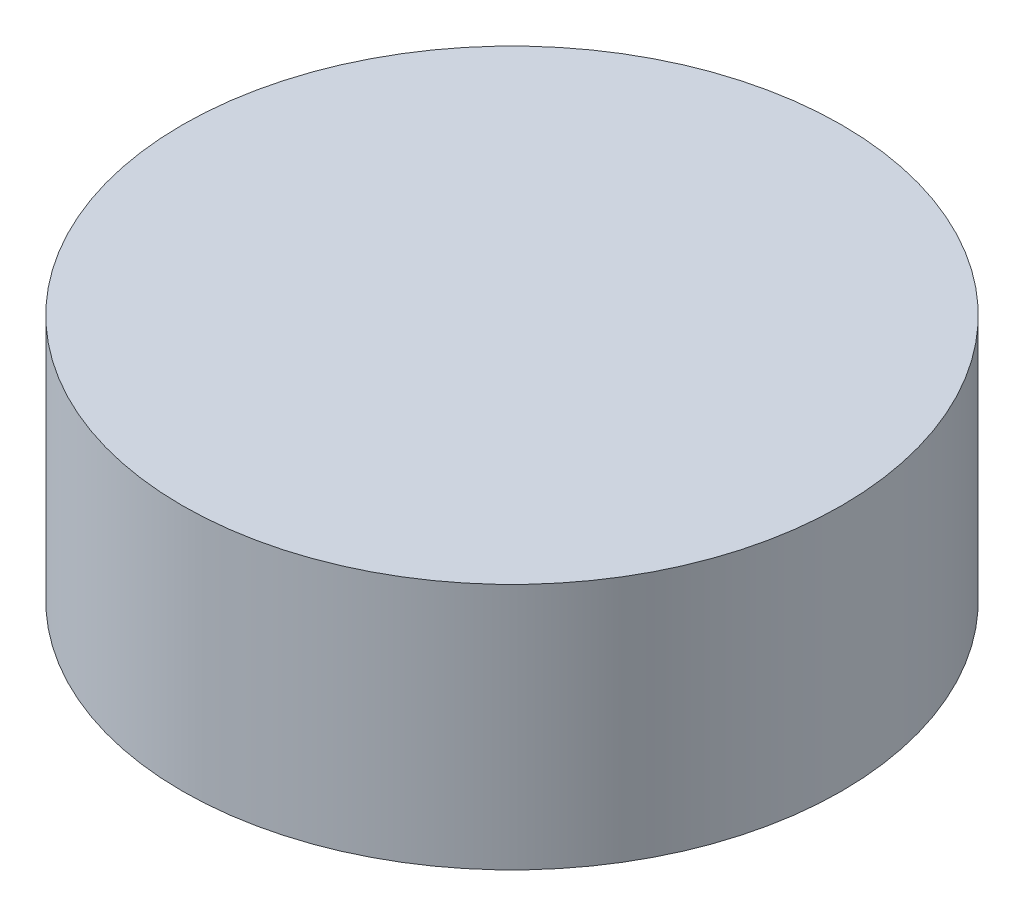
ISO-10303-21;
HEADER;
FILE_DESCRIPTION(('STEP AP214'),'2;1');
FILE_NAME('part.step','',(''),(''),'','','');
FILE_SCHEMA(('AUTOMOTIVE_DESIGN { 1 0 10303 214 1 1 1 1 }'));
ENDSEC;
DATA;
#1=APPLICATION_CONTEXT('core data for automotive mechanical design processes');
#2=APPLICATION_PROTOCOL_DEFINITION('international standard','automotive_design',2000,#1);
#3=PRODUCT_CONTEXT('',#1,'mechanical');
#4=PRODUCT('Part','Part','',(#3));
#5=PRODUCT_RELATED_PRODUCT_CATEGORY('part','',(#4));
#6=PRODUCT_DEFINITION_FORMATION('','',#4);
#7=PRODUCT_DEFINITION_CONTEXT('part definition',#1,'design');
#8=PRODUCT_DEFINITION('design','',#6,#7);
#9=PRODUCT_DEFINITION_SHAPE('','',#8);
#10=(LENGTH_UNIT() NAMED_UNIT(*) SI_UNIT(.MILLI.,.METRE.));
#11=(NAMED_UNIT(*) PLANE_ANGLE_UNIT() SI_UNIT($,.RADIAN.));
#12=(NAMED_UNIT(*) SI_UNIT($,.STERADIAN.) SOLID_ANGLE_UNIT());
#13=UNCERTAINTY_MEASURE_WITH_UNIT(LENGTH_MEASURE(1.E-05),#10,'distance_accuracy_value','');
#14=(GEOMETRIC_REPRESENTATION_CONTEXT(3) GLOBAL_UNCERTAINTY_ASSIGNED_CONTEXT((#13)) GLOBAL_UNIT_ASSIGNED_CONTEXT((#10,
#11,#12)) REPRESENTATION_CONTEXT('',''));
#15=CARTESIAN_POINT('',(0.,0.,0.));
#16=DIRECTION('',(0.,0.,1.));
#17=DIRECTION('',(1.,0.,0.));
#18=AXIS2_PLACEMENT_3D('',#15,#16,#17);
#19=CARTESIAN_POINT('',(0.,3.048,0.));
#20=DIRECTION('',(0.,-1.,0.));
#21=DIRECTION('',(0.,0.,-1.));
#22=AXIS2_PLACEMENT_3D('',#19,#20,#21);
#23=CYLINDRICAL_SURFACE('',#22,4.064);
#24=CARTESIAN_POINT('',(0.,3.048,0.));
#25=DIRECTION('',(0.,1.,0.));
#26=DIRECTION('',(0.,0.,1.));
#27=AXIS2_PLACEMENT_3D('',#24,#25,#26);
#28=CIRCLE('',#27,4.064);
#29=CARTESIAN_POINT('',(0.,3.048,-4.064));
#30=VERTEX_POINT('',#29);
#31=EDGE_CURVE('E10',#30,#30,#28,.T.);
#32=CARTESIAN_POINT('',(0.,0.,0.));
#33=DIRECTION('',(0.,1.,0.));
#34=DIRECTION('',(0.,0.,1.));
#35=AXIS2_PLACEMENT_3D('',#32,#33,#34);
#36=CIRCLE('',#35,4.064);
#37=CARTESIAN_POINT('',(0.,0.,-4.064));
#38=VERTEX_POINT('',#37);
#39=EDGE_CURVE('E35',#38,#38,#36,.T.);
#40=CARTESIAN_POINT('',(0.,3.048,-4.064));
#41=CARTESIAN_POINT('',(0.,3.01625,-4.064));
#42=CARTESIAN_POINT('',(0.,2.9845,-4.064));
#43=CARTESIAN_POINT('',(0.,2.921,-4.064));
#44=CARTESIAN_POINT('',(0.,2.88925,-4.064));
#45=CARTESIAN_POINT('',(0.,2.82575,-4.064));
#46=CARTESIAN_POINT('',(0.,2.794,-4.064));
#47=CARTESIAN_POINT('',(0.,2.7305,-4.064));
#48=CARTESIAN_POINT('',(0.,2.69875,-4.064));
#49=CARTESIAN_POINT('',(0.,2.63525,-4.064));
#50=CARTESIAN_POINT('',(0.,2.6035,-4.064));
#51=CARTESIAN_POINT('',(0.,2.54,-4.064));
#52=CARTESIAN_POINT('',(0.,2.50825,-4.064));
#53=CARTESIAN_POINT('',(0.,2.44475,-4.064));
#54=CARTESIAN_POINT('',(0.,2.413,-4.064));
#55=CARTESIAN_POINT('',(0.,2.3495,-4.064));
#56=CARTESIAN_POINT('',(0.,2.31775,-4.064));
#57=CARTESIAN_POINT('',(0.,2.25425,-4.064));
#58=CARTESIAN_POINT('',(0.,2.2225,-4.064));
#59=CARTESIAN_POINT('',(0.,2.159,-4.064));
#60=CARTESIAN_POINT('',(0.,2.12725,-4.064));
#61=CARTESIAN_POINT('',(0.,2.06375,-4.064));
#62=CARTESIAN_POINT('',(0.,2.032,-4.064));
#63=CARTESIAN_POINT('',(0.,1.9685,-4.064));
#64=CARTESIAN_POINT('',(0.,1.93675,-4.064));
#65=CARTESIAN_POINT('',(0.,1.87325,-4.064));
#66=CARTESIAN_POINT('',(0.,1.8415,-4.064));
#67=CARTESIAN_POINT('',(0.,1.778,-4.064));
#68=CARTESIAN_POINT('',(0.,1.74625,-4.064));
#69=CARTESIAN_POINT('',(0.,1.68275,-4.064));
#70=CARTESIAN_POINT('',(0.,1.651,-4.064));
#71=CARTESIAN_POINT('',(0.,1.5875,-4.064));
#72=CARTESIAN_POINT('',(0.,1.55575,-4.064));
#73=CARTESIAN_POINT('',(0.,1.49225,-4.064));
#74=CARTESIAN_POINT('',(0.,1.4605,-4.064));
#75=CARTESIAN_POINT('',(0.,1.397,-4.064));
#76=CARTESIAN_POINT('',(0.,1.36525,-4.064));
#77=CARTESIAN_POINT('',(0.,1.30175,-4.064));
#78=CARTESIAN_POINT('',(0.,1.27,-4.064));
#79=CARTESIAN_POINT('',(0.,1.2065,-4.064));
#80=CARTESIAN_POINT('',(0.,1.17475,-4.064));
#81=CARTESIAN_POINT('',(0.,1.11125,-4.064));
#82=CARTESIAN_POINT('',(0.,1.0795,-4.064));
#83=CARTESIAN_POINT('',(0.,1.016,-4.064));
#84=CARTESIAN_POINT('',(0.,0.98425,-4.064));
#85=CARTESIAN_POINT('',(0.,0.92075,-4.064));
#86=CARTESIAN_POINT('',(0.,0.889,-4.064));
#87=CARTESIAN_POINT('',(0.,0.8255,-4.064));
#88=CARTESIAN_POINT('',(0.,0.79375,-4.064));
#89=CARTESIAN_POINT('',(0.,0.73025,-4.064));
#90=CARTESIAN_POINT('',(0.,0.6985,-4.064));
#91=CARTESIAN_POINT('',(0.,0.635,-4.064));
#92=CARTESIAN_POINT('',(0.,0.60325,-4.064));
#93=CARTESIAN_POINT('',(0.,0.53975,-4.064));
#94=CARTESIAN_POINT('',(0.,0.508,-4.064));
#95=CARTESIAN_POINT('',(0.,0.4445,-4.064));
#96=CARTESIAN_POINT('',(0.,0.41275,-4.064));
#97=CARTESIAN_POINT('',(0.,0.34925,-4.064));
#98=CARTESIAN_POINT('',(0.,0.3175,-4.064));
#99=CARTESIAN_POINT('',(0.,0.254,-4.064));
#100=CARTESIAN_POINT('',(0.,0.22225,-4.064));
#101=CARTESIAN_POINT('',(0.,0.15875,-4.064));
#102=CARTESIAN_POINT('',(0.,0.127,-4.064));
#103=CARTESIAN_POINT('',(0.,0.0634999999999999,-4.064));
#104=CARTESIAN_POINT('',(0.,0.03175,-4.064));
#105=CARTESIAN_POINT('',(0.,0.,-4.064));
#106=B_SPLINE_CURVE_WITH_KNOTS('',3,(#40,#41,#42,#43,#44,#45,#46,#47,#48,#49,#50,#51,#52,#53,
#54,#55,#56,#57,#58,#59,#60,#61,#62,#63,#64,#65,#66,#67,#68,#69,#70,#71,#72,#73,#74,#75,#76,#77,
#78,#79,#80,#81,#82,#83,#84,#85,#86,#87,#88,#89,#90,#91,#92,#93,#94,#95,#96,#97,#98,#99,#100,
#101,#102,#103,#104,#105),.UNSPECIFIED.,.F.,.F.,(4,2,2,2,2,2,2,2,2,2,2,2,2,2,2,2,2,2,2,2,2,2,2,
2,2,2,2,2,2,2,2,2,4),(0.,0.0952500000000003,0.1905,0.28575,0.381,0.47625,0.5715,0.66675,0.762,
0.85725,0.9525,1.04775,1.143,1.23825,1.3335,1.42875,1.524,1.61925,1.7145,1.80975,1.905,2.00025,
2.0955,2.19075,2.286,2.38125,2.4765,2.57175,2.667,2.76225,2.8575,2.95275,3.048),.UNSPECIFIED.);
#107=EDGE_CURVE('BSEAM32',#30,#38,#106,.T.);
#108=ORIENTED_EDGE('',*,*,#31,.F.);
#109=ORIENTED_EDGE('',*,*,#39,.T.);
#110=ORIENTED_EDGE('',*,*,#107,.T.);
#111=ORIENTED_EDGE('',*,*,#107,.F.);
#112=EDGE_LOOP('',(#108,#110,#109,#111));
#113=FACE_BOUND('',#112,.T.);
#114=ADVANCED_FACE('F32',(#113),#23,.T.);
#115=CARTESIAN_POINT('',(0.,3.048,0.));
#116=DIRECTION('',(0.,1.,0.));
#117=DIRECTION('',(0.,0.,1.));
#118=AXIS2_PLACEMENT_3D('',#115,#116,#117);
#119=PLANE('',#118);
#120=ORIENTED_EDGE('',*,*,#31,.T.);
#121=EDGE_LOOP('',(#120));
#122=FACE_BOUND('',#121,.T.);
#123=ADVANCED_FACE('F47',(#122),#119,.T.);
#124=CARTESIAN_POINT('',(0.,0.,0.));
#125=DIRECTION('',(0.,1.,0.));
#126=DIRECTION('',(0.,0.,1.));
#127=AXIS2_PLACEMENT_3D('',#124,#125,#126);
#128=PLANE('',#127);
#129=ORIENTED_EDGE('',*,*,#39,.F.);
#130=EDGE_LOOP('',(#129));
#131=FACE_BOUND('',#130,.T.);
#132=ADVANCED_FACE('F45',(#131),#128,.F.);
#133=CLOSED_SHELL('',(#114,#123,#132));
#134=MANIFOLD_SOLID_BREP('B2',#133);
#135=ADVANCED_BREP_SHAPE_REPRESENTATION('',(#18,#134),#14);
#136=SHAPE_DEFINITION_REPRESENTATION(#9,#135);
ENDSEC;
END-ISO-10303-21;
